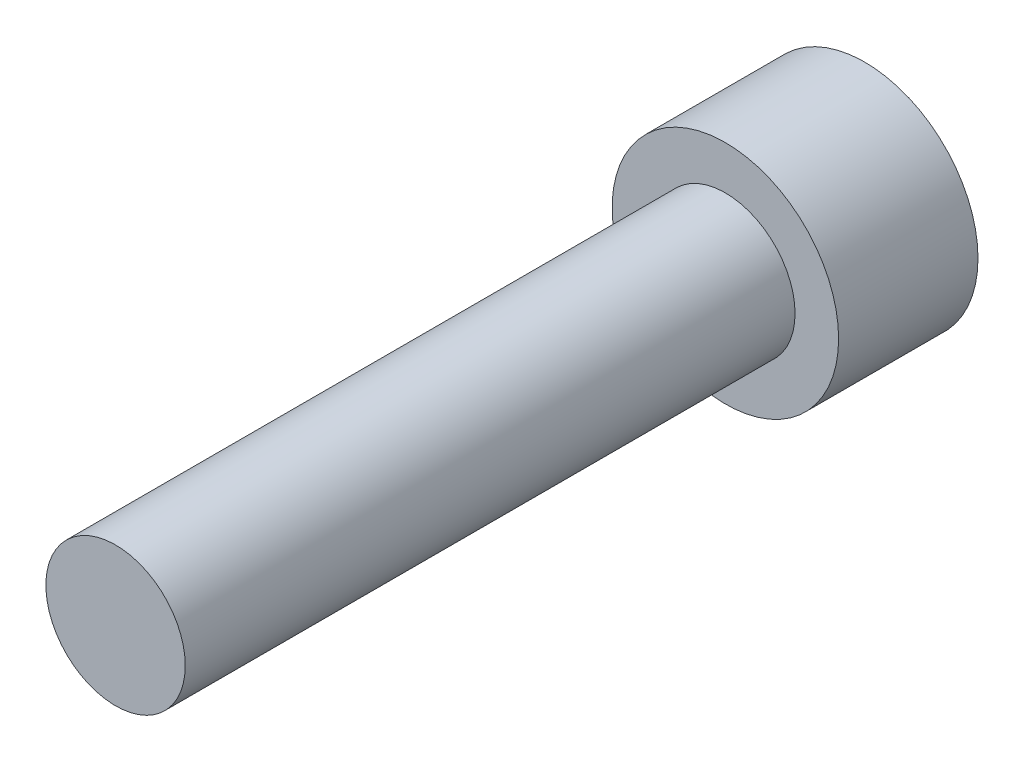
from build123d import *

# Parameters (mm, degrees)
HEX_2_DEPTH = 6


with BuildPart() as part:
    # Sketch6 → Revolve1 (revolve)
    with BuildSketch(Plane(origin=(0, 0, 0), x_dir=(0, 0, -1), z_dir=(1, 0, 0)), mode=Mode.PRIVATE) as revolve1_sk:
        Polygon((-35, 0), (-35, -4), (0, -4), (0, -6.5), (8, -6.5), (8, 0), align=None)
    revolve(revolve1_sk.sketch.rotate(Axis((0, 0, 35), (0, 0, -1)), 270), axis=Axis((0, 0, 35), (0, 0, -1)))

    # Sketch7 → HEX 2 (cut)
    with BuildSketch(Plane(origin=(0, 0, -8), x_dir=(-1, 0, 0), z_dir=(0, 0, -1))):
        Polygon((-3, 1.732050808), (-3, -1.732050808), (0, -3.464101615), (3, -1.732050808), (3, 1.732050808), (0, 3.464101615), align=None)
    extrude(amount=-HEX_2_DEPTH, mode=Mode.SUBTRACT)


solid = part.part
